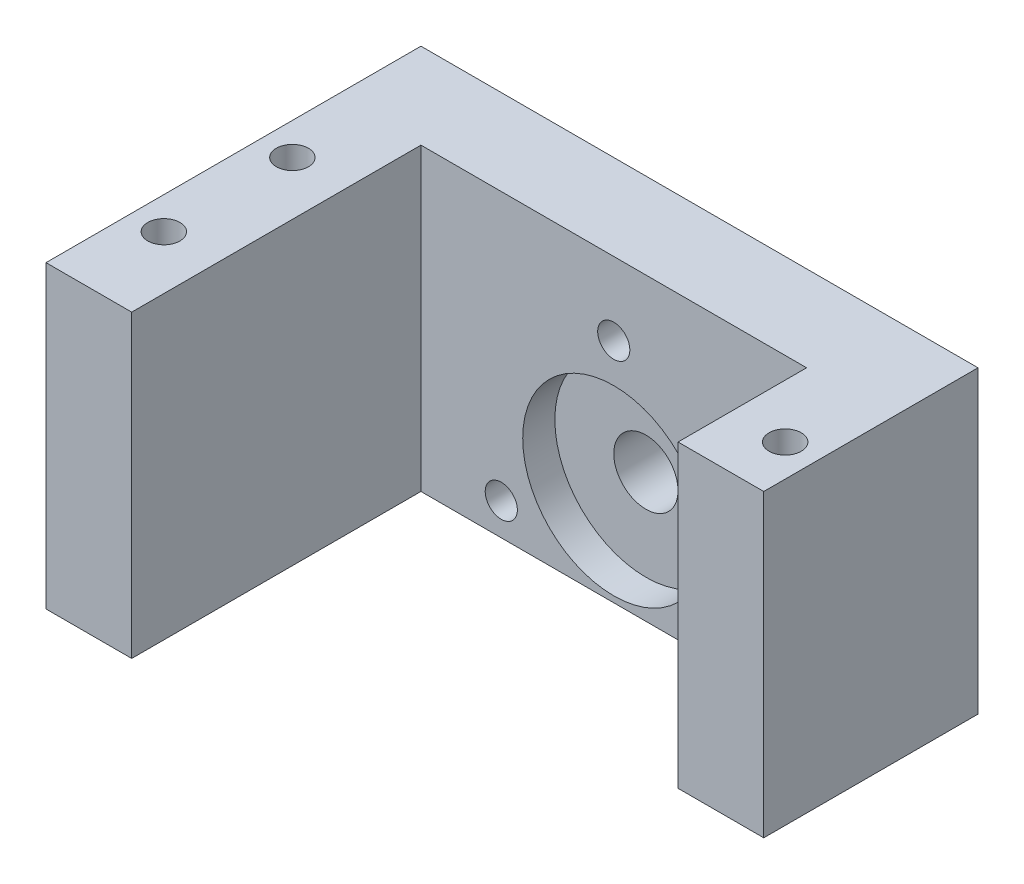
from build123d import *

# Parameters (mm, degrees)
SKETCH_1_W          = 36
SKETCH_1_H          = 28
SKETCH_1_R          = 1.5
SKETCH_1_R_2        = 8.5
EXTRUDE_1_DEPTH     = 8
SKETCH_2_R          = 8.5
SKETCH_2_R_2        = 3
EXTRUDE_2_DEPTH     = 5
SKETCH_3_W          = 8
SKETCH_3_H          = 28
EXTRUDE_3_DEPTH     = 35
SKETCH_4_R          = 1.5
CUT_EXTRUDE_1_DEPTH = 30
SKETCH_5_W          = 8
SKETCH_5_H          = 15
CUT_EXTRUDE_2_DEPTH = 45


with BuildPart() as part:
    # Sketch 1 → Extrude 1 (new body)
    with BuildSketch(Plane.XY):
        Rectangle(SKETCH_1_W, SKETCH_1_H)
        with Locations((-10.5, -11)):
            Circle(SKETCH_1_R, mode=Mode.SUBTRACT)
        with Locations((0, 7.186533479)):
            Circle(SKETCH_1_R, mode=Mode.SUBTRACT)
        with Locations(Location((10.5, -11, 0), (0, 0, 180))):
            Circle(SKETCH_1_R, mode=Mode.SUBTRACT)
        with Locations((0, -4.937822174)):
            Circle(SKETCH_1_R_2, mode=Mode.SUBTRACT)
    extrude(amount=EXTRUDE_1_DEPTH)

    # Sketch 2 → Extrude 2 (add)
    with BuildSketch(Plane(origin=(0, 0, 0), x_dir=(-1, 0, 0), z_dir=(0, 0, -1))):
        with Locations((0, -4.937822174)):
            Circle(SKETCH_2_R)
        with Locations((0, -4.937822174)):
            Circle(SKETCH_2_R_2, mode=Mode.SUBTRACT)
    extrude(amount=-EXTRUDE_2_DEPTH)

    # Sketch 3 → Extrude 3 (add)
    with BuildSketch(Plane(origin=(0, 0, 0), x_dir=(-1, 0, 0), z_dir=(0, 0, -1))):
        with Locations((22, 0)):
            Rectangle(SKETCH_3_W, SKETCH_3_H)
        with Locations((-22, 0)):
            Rectangle(SKETCH_3_W, SKETCH_3_H)
    extrude(amount=-EXTRUDE_3_DEPTH)

    # Sketch 4 → Cut-Extrude 1 (cut)
    with BuildSketch(Plane(origin=(0, 14, 0), x_dir=(1, 0, 0), z_dir=(0, 1, 0))):
        with Locations(Location((-23, -15, 0), (0, 0, 180))):
            Circle(SKETCH_4_R)
        with Locations(Location((-23, -27, 0), (0, 0, 180))):
            Circle(SKETCH_4_R)
        with Locations(Location((23, -15, 0), (0, 0, 180))):
            Circle(SKETCH_4_R)
    extrude(amount=-CUT_EXTRUDE_1_DEPTH, mode=Mode.SUBTRACT)

    # Sketch 5 → Cut-Extrude 2 (cut)
    with BuildSketch(Plane(origin=(0, 14, 0), x_dir=(1, 0, 0), z_dir=(0, 1, 0))):
        with Locations((22, -27.5)):
            Rectangle(SKETCH_5_W, SKETCH_5_H)
    extrude(amount=-CUT_EXTRUDE_2_DEPTH, mode=Mode.SUBTRACT)


solid = part.part
